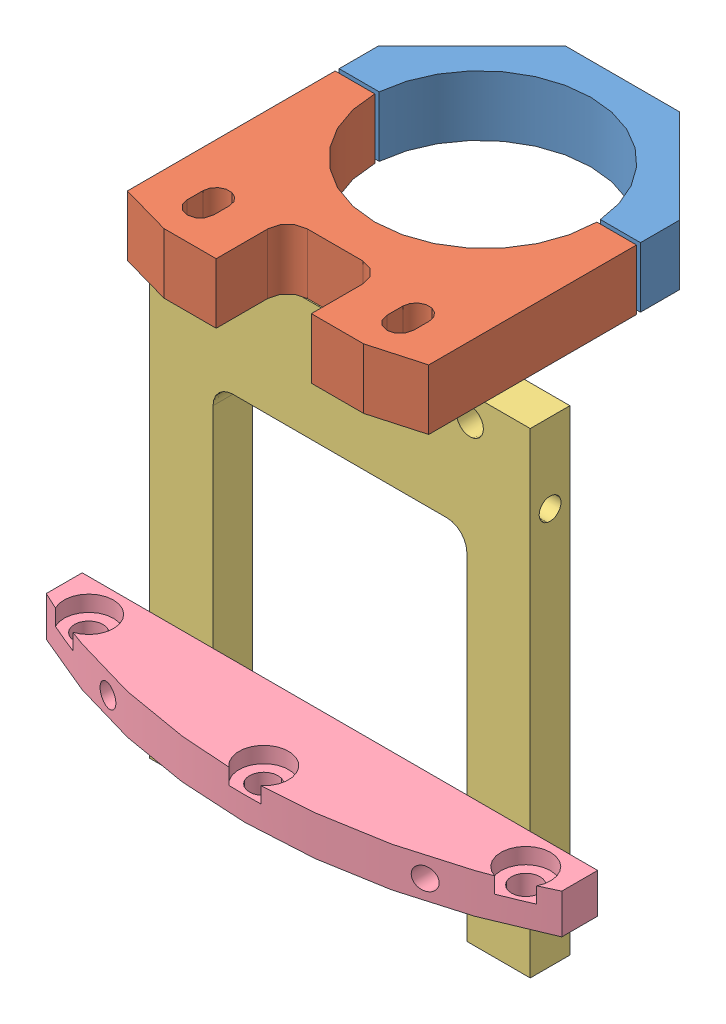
SolidWorks assembly Internal Hydraulic Chassis Tail Hemi.SLDASM, configuration Default (file format 3400). Lengths in mm.
Overall size (166.77 108.9 80.03).
6 component instances, 6 part files, 10 mates.
Components (placement in the parent):
- ISUS - HYDRAULIC BULKHEAD-1: ISUS - HYDRAULIC BULKHEAD.SLDPRT [Default] at origin size (166.77 9.53 80.03)
- GHM-8225a HYDRAULIC PUMP MOUNT-1: GHM-8225a HYDRAULIC PUMP MOUNT.SLDPRT [Default] at (-24.13 9.525 56.8325) size (48.26 9.65 21.27)
- GHM-8225b HYDRAULIC PUMP MOUNT-1: GHM-8225b HYDRAULIC PUMP MOUNT.SLDPRT [Default] at (0 9.525 33.02) size (48.26 9.65 35.56)
- GHM-8225cPumpPlate-1: GHM-8225cPumpPlate.SLDPRT [Default] at (1.3983 -23.8972 72.898) x (0 1 0) z (1 0 0) size (76.2 6.35 60.96)
- GHM-8210b HYDRAULIC BULKHEAD-1: GHM-8210b HYDRAULIC BULKHEAD.SLDPRT [Default] at (0 -53.6575 0) size (82.55 6.35 15.24)
- GHM-8217 Solenoid mount-1: GHM-8217 Solenoid mount.SLDPRT [Default] at (71.7953 41.275 62.5368) x (-0.692551 0 0.721369) z (0 -1 0) size (12.69 7.87 31.75)
Mates (geometry in assembly coordinates):
- Coincident5: coincident anti-aligned: plane of ISUS - HYDRAULIC BULKHEAD-1 through (0 9.525 0) normal (0 1 0); plane of GHM-8225b HYDRAULIC PUMP MOUNT-1 through (0 9.525 55.88) normal (0 -1 0)
- Concentric4: concentric anti-aligned: cylinder of GHM-8225a HYDRAULIC PUMP MOUNT-1; circle of GHM-8225b HYDRAULIC PUMP MOUNT-1
- Concentric5: concentric aligned: circle of GHM-8225a HYDRAULIC PUMP MOUNT-1; circle of GHM-8225b HYDRAULIC PUMP MOUNT-1
- Distance1: distance = 0.635 mm anti-aligned: plane of GHM-8225a HYDRAULIC PUMP MOUNT-1 through (-25.3166 5.5036 55.245) normal (0 0 1); plane of GHM-8225b HYDRAULIC PUMP MOUNT-1 through (-17.78 19.177 55.88) normal (0 0 -1)
- Coincident10: coincident anti-aligned: plane of ISUS - HYDRAULIC BULKHEAD-1 through (37.4002 9.525 79.248) normal (0 0 -1); plane of GHM-8225cPumpPlate-1 through (30.48 -67.6275 79.248) normal (0 0 1)
- Concentric12: concentric anti-aligned: circle of GHM-8225cPumpPlate-1; circle of GHM-8210b HYDRAULIC BULKHEAD-1
- Concentric13: concentric anti-aligned: circle of GHM-8225cPumpPlate-1; circle of GHM-8210b HYDRAULIC BULKHEAD-1
- Coincident11: coincident anti-aligned: plane of GHM-8225cPumpPlate-1 through (30.48 -67.6275 79.248) normal (0 0 1); plane of GHM-8210b HYDRAULIC BULKHEAD-1 through (41.275 -47.3075 79.248) normal (0 0 -1)
- Coincident12: coincident anti-aligned: plane of ISUS - HYDRAULIC BULKHEAD-1 through (0 9.525 0) normal (0 1 0); plane of GHM-8217 Solenoid mount-1 through (66.1194 9.525 57.0878) normal (0 -1 0)
- Concentric14: concentric aligned: cylinder of ISUS - HYDRAULIC BULKHEAD-1; cylinder of GHM-8217 Solenoid mount-1
